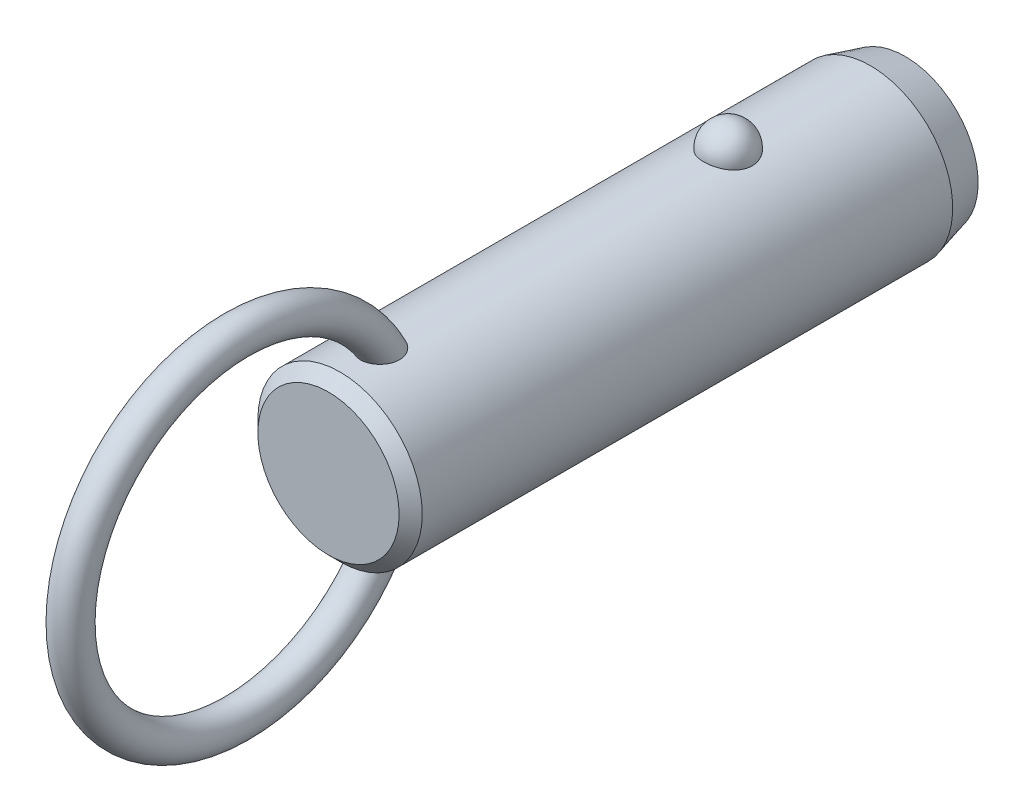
ISO-10303-21;
HEADER;
FILE_DESCRIPTION(('STEP AP214'),'2;1');
FILE_NAME('part.step','',(''),(''),'','','');
FILE_SCHEMA(('AUTOMOTIVE_DESIGN { 1 0 10303 214 1 1 1 1 }'));
ENDSEC;
DATA;
#1=APPLICATION_CONTEXT('core data for automotive mechanical design processes');
#2=APPLICATION_PROTOCOL_DEFINITION('international standard','automotive_design',2000,#1);
#3=PRODUCT_CONTEXT('',#1,'mechanical');
#4=PRODUCT('Part','Part','',(#3));
#5=PRODUCT_RELATED_PRODUCT_CATEGORY('part','',(#4));
#6=PRODUCT_DEFINITION_FORMATION('','',#4);
#7=PRODUCT_DEFINITION_CONTEXT('part definition',#1,'design');
#8=PRODUCT_DEFINITION('design','',#6,#7);
#9=PRODUCT_DEFINITION_SHAPE('','',#8);
#10=(LENGTH_UNIT() NAMED_UNIT(*) SI_UNIT(.MILLI.,.METRE.));
#11=(NAMED_UNIT(*) PLANE_ANGLE_UNIT() SI_UNIT($,.RADIAN.));
#12=(NAMED_UNIT(*) SI_UNIT($,.STERADIAN.) SOLID_ANGLE_UNIT());
#13=UNCERTAINTY_MEASURE_WITH_UNIT(LENGTH_MEASURE(1.E-05),#10,'distance_accuracy_value','');
#14=(GEOMETRIC_REPRESENTATION_CONTEXT(3) GLOBAL_UNCERTAINTY_ASSIGNED_CONTEXT((#13)) GLOBAL_UNIT_ASSIGNED_CONTEXT((#10,
#11,#12)) REPRESENTATION_CONTEXT('',''));
#15=CARTESIAN_POINT('',(0.,0.,0.));
#16=DIRECTION('',(0.,0.,1.));
#17=DIRECTION('',(1.,0.,0.));
#18=AXIS2_PLACEMENT_3D('',#15,#16,#17);
#19=CARTESIAN_POINT('',(0.,0.,24.5));
#20=DIRECTION('',(0.,0.,-1.));
#21=DIRECTION('',(-1.,0.,0.));
#22=AXIS2_PLACEMENT_3D('',#19,#20,#21);
#23=CYLINDRICAL_SURFACE('',#22,7.1);
#24=CARTESIAN_POINT('',(2.0769088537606,6.78943661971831,-2.1));
#25=CARTESIAN_POINT('',(2.07690739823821,6.78943796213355,-1.98268154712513));
#26=CARTESIAN_POINT('',(2.06738130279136,6.79237331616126,-1.86534506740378));
#27=CARTESIAN_POINT('',(2.0295040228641,6.8037853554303,-1.63400788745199));
#28=CARTESIAN_POINT('',(2.00114757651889,6.81226358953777,-1.52000812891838));
#29=CARTESIAN_POINT('',(1.92632025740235,6.83379798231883,-1.29863433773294));
#30=CARTESIAN_POINT('',(1.87985726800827,6.84685214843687,-1.19125744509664));
#31=CARTESIAN_POINT('',(1.76995205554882,6.87608091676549,-0.98604657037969));
#32=CARTESIAN_POINT('',(1.70650980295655,6.8922555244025,-0.88821260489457));
#33=CARTESIAN_POINT('',(1.5638119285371,6.92602930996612,-0.704242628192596));
#34=CARTESIAN_POINT('',(1.4844714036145,6.94363582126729,-0.618173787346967));
#35=CARTESIAN_POINT('',(1.31221746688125,6.97823658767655,-0.460740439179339));
#36=CARTESIAN_POINT('',(1.21930409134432,6.99523084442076,-0.389375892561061));
#37=CARTESIAN_POINT('',(1.02268781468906,7.02666176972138,-0.263547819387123));
#38=CARTESIAN_POINT('',(0.91902009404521,7.04110638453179,-0.209031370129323));
#39=CARTESIAN_POINT('',(0.703548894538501,7.06588726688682,-0.118163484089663));
#40=CARTESIAN_POINT('',(0.591746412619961,7.07622403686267,-0.0818098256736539));
#41=CARTESIAN_POINT('',(0.365557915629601,7.09147068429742,-0.0288711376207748));
#42=CARTESIAN_POINT('',(0.251267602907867,7.09648447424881,-0.0119070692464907));
#43=CARTESIAN_POINT('',(0.0213499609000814,7.10089837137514,0.00304925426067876));
#44=CARTESIAN_POINT('',(-0.0942772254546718,7.10029907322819,0.00104351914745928));
#45=CARTESIAN_POINT('',(-0.321651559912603,7.09360829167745,-0.0216931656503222));
#46=CARTESIAN_POINT('',(-0.433431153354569,7.08760388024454,-0.0421272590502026));
#47=CARTESIAN_POINT('',(-0.651862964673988,7.07086131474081,-0.100729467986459));
#48=CARTESIAN_POINT('',(-0.758515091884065,7.06012307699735,-0.138897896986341));
#49=CARTESIAN_POINT('',(-0.964449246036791,7.03496097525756,-0.232213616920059));
#50=CARTESIAN_POINT('',(-1.06368095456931,7.02051445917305,-0.287465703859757));
#51=CARTESIAN_POINT('',(-1.25145353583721,6.98948740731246,-0.413383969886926));
#52=CARTESIAN_POINT('',(-1.33999321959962,6.97290663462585,-0.48405186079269));
#53=CARTESIAN_POINT('',(-1.50591604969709,6.93898770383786,-0.640594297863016));
#54=CARTESIAN_POINT('',(-1.58302488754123,6.92164094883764,-0.726757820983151));
#55=CARTESIAN_POINT('',(-1.72189320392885,6.8884103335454,-0.91092752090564));
#56=CARTESIAN_POINT('',(-1.78365144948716,6.87252659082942,-1.008934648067));
#57=CARTESIAN_POINT('',(-1.89101272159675,6.84377189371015,-1.21549497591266));
#58=CARTESIAN_POINT('',(-1.93639553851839,6.83094274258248,-1.32416860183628));
#59=CARTESIAN_POINT('',(-2.00874275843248,6.81002070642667,-1.54791500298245));
#60=CARTESIAN_POINT('',(-2.03570774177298,6.80192767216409,-1.66298757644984));
#61=CARTESIAN_POINT('',(-2.07047276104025,6.7914266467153,-1.89571453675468));
#62=CARTESIAN_POINT('',(-2.07835878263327,6.78899315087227,-2.01335491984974));
#63=CARTESIAN_POINT('',(-2.07502083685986,6.79001409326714,-2.24833570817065));
#64=CARTESIAN_POINT('',(-2.06379746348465,6.7934683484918,-2.36567612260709));
#65=CARTESIAN_POINT('',(-2.02263913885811,6.80583442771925,-2.59603194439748));
#66=CARTESIAN_POINT('',(-1.99281127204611,6.81471501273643,-2.70906820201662));
#67=CARTESIAN_POINT('',(-1.91526639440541,6.83691232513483,-2.92836575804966));
#68=CARTESIAN_POINT('',(-1.8675486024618,6.85022924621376,-3.03462676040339));
#69=CARTESIAN_POINT('',(-1.75504492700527,6.87991336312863,-3.23806487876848));
#70=CARTESIAN_POINT('',(-1.69015924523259,6.89629822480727,-3.33518422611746));
#71=CARTESIAN_POINT('',(-1.54505404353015,6.93024852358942,-3.51697105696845));
#72=CARTESIAN_POINT('',(-1.46483385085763,6.94781401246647,-3.60163799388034));
#73=CARTESIAN_POINT('',(-1.29071406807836,6.98225977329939,-3.75654119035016));
#74=CARTESIAN_POINT('',(-1.19675650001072,6.99913673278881,-3.82671308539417));
#75=CARTESIAN_POINT('',(-0.997940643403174,7.03023618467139,-3.9501837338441));
#76=CARTESIAN_POINT('',(-0.89308318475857,7.04445887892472,-4.00348377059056));
#77=CARTESIAN_POINT('',(-0.676902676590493,7.06848365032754,-4.09107242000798));
#78=CARTESIAN_POINT('',(-0.565686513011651,7.0783430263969,-4.12560889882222));
#79=CARTESIAN_POINT('',(-0.338739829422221,7.09282534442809,-4.17575450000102));
#80=CARTESIAN_POINT('',(-0.223009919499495,7.09744899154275,-4.19136617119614));
#81=CARTESIAN_POINT('',(0.00707628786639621,7.10090930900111,-4.20307965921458));
#82=CARTESIAN_POINT('',(0.121410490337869,7.09986531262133,-4.19958377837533));
#83=CARTESIAN_POINT('',(0.347815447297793,7.092380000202,-4.17411564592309));
#84=CARTESIAN_POINT('',(0.459886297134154,7.08593891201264,-4.15214417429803));
#85=CARTESIAN_POINT('',(0.678084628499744,7.06838983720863,-4.09049562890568));
#86=CARTESIAN_POINT('',(0.784237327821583,7.05730369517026,-4.05090137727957));
#87=CARTESIAN_POINT('',(0.988305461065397,7.03163139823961,-3.95511447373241));
#88=CARTESIAN_POINT('',(1.08622031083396,7.01704499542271,-3.89892064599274));
#89=CARTESIAN_POINT('',(1.27284490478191,6.98562668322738,-3.77035541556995));
#90=CARTESIAN_POINT('',(1.36137372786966,6.96876135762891,-3.69772964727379));
#91=CARTESIAN_POINT('',(1.52509486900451,6.93477412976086,-3.53878279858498));
#92=CARTESIAN_POINT('',(1.60028496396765,6.91765218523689,-3.45245943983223));
#93=CARTESIAN_POINT('',(1.73681688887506,6.88465753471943,-3.26658774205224));
#94=CARTESIAN_POINT('',(1.79785966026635,6.86881574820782,-3.16681408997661));
#95=CARTESIAN_POINT('',(1.90265327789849,6.84053157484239,-2.95814408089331));
#96=CARTESIAN_POINT('',(1.94640861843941,6.82808830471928,-2.84925010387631));
#97=CARTESIAN_POINT('',(2.01274378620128,6.80881460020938,-2.63454318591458));
#98=CARTESIAN_POINT('',(2.03676193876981,6.80160856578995,-2.52920574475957));
#99=CARTESIAN_POINT('',(2.06884490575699,6.79191902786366,-2.3159172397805));
#100=CARTESIAN_POINT('',(2.07691019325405,6.78943538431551,-2.20796625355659));
#101=CARTESIAN_POINT('',(2.0769088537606,6.78943661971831,-2.1));
#102=B_SPLINE_CURVE_WITH_KNOTS('',3,(#24,#25,#26,#27,#28,#29,#30,#31,#32,#33,#34,#35,#36,#37,
#38,#39,#40,#41,#42,#43,#44,#45,#46,#47,#48,#49,#50,#51,#52,#53,#54,#55,#56,#57,#58,#59,#60,#61,
#62,#63,#64,#65,#66,#67,#68,#69,#70,#71,#72,#73,#74,#75,#76,#77,#78,#79,#80,#81,#82,#83,#84,#85,
#86,#87,#88,#89,#90,#91,#92,#93,#94,#95,#96,#97,#98,#99,#100,#101),.UNSPECIFIED.,.T.,.F.,(4,2,2,
2,2,2,2,2,2,2,2,2,2,2,2,2,2,2,2,2,2,2,2,2,2,2,2,2,2,2,2,2,2,2,2,2,2,2,4),(0.,0.351568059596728,
0.703234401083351,1.05474780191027,1.40626181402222,1.75970563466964,2.11314851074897,
2.4654696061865,2.81774759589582,3.16301449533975,3.50824481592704,3.84801136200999,
4.18778391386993,4.52968352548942,4.87162112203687,5.22076181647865,5.56993054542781,
5.92363364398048,6.27732559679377,6.62942052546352,6.98150450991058,7.33158042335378,
7.68167162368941,8.03384443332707,8.38603269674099,8.73975272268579,9.09344583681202,
9.44234545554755,9.79119807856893,10.1327344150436,10.4742563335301,10.8141898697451,
11.1541474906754,11.4997793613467,11.8454687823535,12.1979079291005,12.5502553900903,
12.8738073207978,13.1973496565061),.UNSPECIFIED.);
#103=CARTESIAN_POINT('',(2.0769088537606,6.78943661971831,-2.1));
#104=VERTEX_POINT('',#103);
#105=EDGE_CURVE('E41',#104,#104,#102,.T.);
#106=ORIENTED_EDGE('',*,*,#105,.T.);
#107=EDGE_LOOP('',(#106));
#108=FACE_BOUND('',#107,.T.);
#109=CARTESIAN_POINT('',(0.,0.,31.42));
#110=DIRECTION('',(0.,0.,1.));
#111=DIRECTION('',(1.,0.,0.));
#112=AXIS2_PLACEMENT_3D('',#109,#110,#111);
#113=CIRCLE('',#112,7.1);
#114=CARTESIAN_POINT('',(7.1,0.,31.42));
#115=VERTEX_POINT('',#114);
#116=EDGE_CURVE('E10',#115,#115,#113,.F.);
#117=ORIENTED_EDGE('',*,*,#116,.T.);
#118=EDGE_LOOP('',(#117));
#119=FACE_BOUND('',#118,.T.);
#120=CARTESIAN_POINT('',(-0.429539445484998,-7.08699541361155,26.2429212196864));
#121=CARTESIAN_POINT('',(-0.508331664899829,-7.08221999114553,26.2668764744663));
#122=CARTESIAN_POINT('',(-0.585039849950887,-7.07624016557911,26.2974570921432));
#123=CARTESIAN_POINT('',(-0.732082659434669,-7.06254296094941,26.3710242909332));
#124=CARTESIAN_POINT('',(-0.802417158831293,-7.05482554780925,26.4140111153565));
#125=CARTESIAN_POINT('',(-0.934722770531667,-7.03851844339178,26.5111135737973));
#126=CARTESIAN_POINT('',(-0.99670020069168,-7.02992941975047,26.5652207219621));
#127=CARTESIAN_POINT('',(-1.11079942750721,-7.01280697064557,26.6829676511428));
#128=CARTESIAN_POINT('',(-1.16292136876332,-7.00427354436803,26.7466072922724));
#129=CARTESIAN_POINT('',(-1.25705660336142,-6.98799959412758,26.8826870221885));
#130=CARTESIAN_POINT('',(-1.29888032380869,-6.98027525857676,26.9552598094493));
#131=CARTESIAN_POINT('',(-1.37069920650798,-6.96652886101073,27.1061686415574));
#132=CARTESIAN_POINT('',(-1.40069157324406,-6.96050720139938,27.1845060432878));
#133=CARTESIAN_POINT('',(-1.45043507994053,-6.95031881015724,27.3501903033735));
#134=CARTESIAN_POINT('',(-1.46937115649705,-6.94630231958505,27.4377897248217));
#135=CARTESIAN_POINT('',(-1.49424917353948,-6.94099239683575,27.6148714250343));
#136=CARTESIAN_POINT('',(-1.50018601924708,-6.93970003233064,27.7043544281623));
#137=CARTESIAN_POINT('',(-1.49978214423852,-6.93978815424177,27.8940607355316));
#138=CARTESIAN_POINT('',(-1.49187639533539,-6.94150934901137,27.994279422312));
#139=CARTESIAN_POINT('',(-1.46177925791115,-6.94790814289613,28.1924798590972));
#140=CARTESIAN_POINT('',(-1.43957541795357,-6.95258831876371,28.290459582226));
#141=CARTESIAN_POINT('',(-1.37783293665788,-6.96510647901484,28.4953629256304));
#142=CARTESIAN_POINT('',(-1.33634073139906,-6.97328848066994,28.6016801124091));
#143=CARTESIAN_POINT('',(-1.23686994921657,-6.99161706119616,28.8061777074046));
#144=CARTESIAN_POINT('',(-1.17889192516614,-7.00176357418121,28.9043583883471));
#145=CARTESIAN_POINT('',(-1.05875124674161,-7.02082898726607,29.0723743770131));
#146=CARTESIAN_POINT('',(-0.999247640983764,-7.02963746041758,29.1441230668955));
#147=CARTESIAN_POINT('',(-0.869494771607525,-7.04686074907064,29.2771959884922));
#148=CARTESIAN_POINT('',(-0.799263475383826,-7.05527619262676,29.3385372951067));
#149=CARTESIAN_POINT('',(-0.665408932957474,-7.06899457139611,29.4351316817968));
#150=CARTESIAN_POINT('',(-0.60381789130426,-7.07457275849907,29.4731512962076));
#151=CARTESIAN_POINT('',(-0.475172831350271,-7.08437420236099,29.5387581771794));
#152=CARTESIAN_POINT('',(-0.408123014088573,-7.08859848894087,29.5663533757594));
#153=CARTESIAN_POINT('',(-0.269431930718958,-7.09522749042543,29.6092569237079));
#154=CARTESIAN_POINT('',(-0.197757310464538,-7.09761688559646,29.6244618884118));
#155=CARTESIAN_POINT('',(-0.0527849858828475,-7.10017268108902,29.6407168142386));
#156=CARTESIAN_POINT('',(0.0205115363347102,-7.10034065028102,29.6417767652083));
#157=CARTESIAN_POINT('',(0.156426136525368,-7.09855986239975,29.6304619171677));
#158=CARTESIAN_POINT('',(0.21919982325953,-7.09688191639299,29.6198060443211));
#159=CARTESIAN_POINT('',(0.342134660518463,-7.09201880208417,29.5885379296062));
#160=CARTESIAN_POINT('',(0.402295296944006,-7.08883333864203,29.5679237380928));
#161=CARTESIAN_POINT('',(0.520687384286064,-7.08113868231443,29.5172125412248));
#162=CARTESIAN_POINT('',(0.578791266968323,-7.07658958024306,29.4868272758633));
#163=CARTESIAN_POINT('',(0.690173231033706,-7.06659708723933,29.4183678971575));
#164=CARTESIAN_POINT('',(0.74344785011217,-7.061153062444,29.3802883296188));
#165=CARTESIAN_POINT('',(0.870947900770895,-7.04680292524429,29.2765929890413));
#166=CARTESIAN_POINT('',(0.941828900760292,-7.0375580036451,29.2068972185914));
#167=CARTESIAN_POINT('',(1.07136606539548,-7.01900793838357,29.0569450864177));
#168=CARTESIAN_POINT('',(1.13000013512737,-7.00970271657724,28.9766700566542));
#169=CARTESIAN_POINT('',(1.23579584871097,-6.99183327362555,28.8068997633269));
#170=CARTESIAN_POINT('',(1.2827427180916,-6.98328455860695,28.7172696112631));
#171=CARTESIAN_POINT('',(1.36351442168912,-6.96796352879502,28.5321763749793));
#172=CARTESIAN_POINT('',(1.39733971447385,-6.96119115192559,28.4367134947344));
#173=CARTESIAN_POINT('',(1.45579181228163,-6.94922464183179,28.2253092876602));
#174=CARTESIAN_POINT('',(1.47790145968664,-6.94449000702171,28.108631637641));
#175=CARTESIAN_POINT('',(1.50168752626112,-6.93938731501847,27.8730153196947));
#176=CARTESIAN_POINT('',(1.50336085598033,-6.93901991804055,27.7540763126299));
#177=CARTESIAN_POINT('',(1.48486516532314,-6.9430010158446,27.5236079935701));
#178=CARTESIAN_POINT('',(1.46573441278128,-6.9471253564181,27.411995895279));
#179=CARTESIAN_POINT('',(1.40606892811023,-6.95944667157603,27.1948868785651));
#180=CARTESIAN_POINT('',(1.3655644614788,-6.96763788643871,27.0893815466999));
#181=CARTESIAN_POINT('',(1.27082700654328,-6.98548038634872,26.9042879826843));
#182=CARTESIAN_POINT('',(1.21949810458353,-6.99473841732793,26.8231719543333));
#183=CARTESIAN_POINT('',(1.10242050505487,-7.01414069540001,26.6722278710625));
#184=CARTESIAN_POINT('',(1.03668119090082,-7.02428436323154,26.6023925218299));
#185=CARTESIAN_POINT('',(0.900559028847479,-7.04295285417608,26.4835735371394));
#186=CARTESIAN_POINT('',(0.831428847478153,-7.05153466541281,26.4331573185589));
#187=CARTESIAN_POINT('',(0.685291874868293,-7.06723150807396,26.3451429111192));
#188=CARTESIAN_POINT('',(0.60828720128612,-7.0743469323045,26.3075412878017));
#189=CARTESIAN_POINT('',(0.451878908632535,-7.08602232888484,26.2474915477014));
#190=CARTESIAN_POINT('',(0.372686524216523,-7.09067127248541,26.2245088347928));
#191=CARTESIAN_POINT('',(0.21147739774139,-7.09730788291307,26.1920357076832));
#192=CARTESIAN_POINT('',(0.129460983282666,-7.09929585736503,26.1825437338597));
#193=CARTESIAN_POINT('',(-0.0332905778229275,-7.10037858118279,26.1773517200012));
#194=CARTESIAN_POINT('',(-0.114016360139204,-7.09953334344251,26.1813656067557));
#195=CARTESIAN_POINT('',(-0.273670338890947,-7.09517338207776,26.2024540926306));
#196=CARTESIAN_POINT('',(-0.352598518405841,-7.09165863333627,26.2195288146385));
#197=CARTESIAN_POINT('',(-0.429539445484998,-7.08699541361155,26.2429212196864));
#198=B_SPLINE_CURVE_WITH_KNOTS('',3,(#120,#121,#122,#123,#124,#125,#126,#127,#128,#129,#130,
#131,#132,#133,#134,#135,#136,#137,#138,#139,#140,#141,#142,#143,#144,#145,#146,#147,#148,#149,
#150,#151,#152,#153,#154,#155,#156,#157,#158,#159,#160,#161,#162,#163,#164,#165,#166,#167,#168,
#169,#170,#171,#172,#173,#174,#175,#176,#177,#178,#179,#180,#181,#182,#183,#184,#185,#186,#187,
#188,#189,#190,#191,#192,#193,#194,#195,#196,#197),.UNSPECIFIED.,.T.,.F.,(4,2,2,2,2,2,2,2,2,2,2,
2,2,2,2,2,2,2,2,2,2,2,2,2,2,2,2,2,2,2,2,2,2,2,2,2,2,2,4),(0.,0.247183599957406,
0.494372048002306,0.741372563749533,0.988369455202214,1.23962059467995,1.49093106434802,
1.75897818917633,2.02713035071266,2.32758265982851,2.62829697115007,2.97008736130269,
3.31186629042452,3.59175319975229,3.87117637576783,4.08813841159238,4.30493502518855,
4.52352259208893,4.7419557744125,4.93215328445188,5.12238804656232,5.31884850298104,
5.51544871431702,5.81332317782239,6.11173048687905,6.41527266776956,6.71880423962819,
7.07358156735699,7.42841252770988,7.76631485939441,8.10373999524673,8.39142246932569,
8.67891817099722,8.93560332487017,9.19221962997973,9.43881106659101,9.68537399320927,
9.92674752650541,10.1681233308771),.UNSPECIFIED.);
#199=CARTESIAN_POINT('',(-0.429539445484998,-7.08699541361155,26.2429212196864));
#200=VERTEX_POINT('',#199);
#201=EDGE_CURVE('E59',#200,#200,#198,.T.);
#202=ORIENTED_EDGE('',*,*,#201,.T.);
#203=EDGE_LOOP('',(#202));
#204=FACE_BOUND('',#203,.T.);
#205=CARTESIAN_POINT('',(-0.429539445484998,7.08699541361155,26.2429212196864));
#206=CARTESIAN_POINT('',(-0.35166550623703,7.09171429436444,26.2192469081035));
#207=CARTESIAN_POINT('',(-0.271733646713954,7.09525896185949,26.2020369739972));
#208=CARTESIAN_POINT('',(-0.110026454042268,7.09960839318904,26.1810059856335));
#209=CARTESIAN_POINT('',(-0.0282502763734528,7.10041187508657,26.177191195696));
#210=CARTESIAN_POINT('',(0.134782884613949,7.09918849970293,26.183059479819));
#211=CARTESIAN_POINT('',(0.216039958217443,7.09716214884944,26.1927401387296));
#212=CARTESIAN_POINT('',(0.375730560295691,7.09050177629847,26.2253471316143));
#213=CARTESIAN_POINT('',(0.454164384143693,7.08586802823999,26.2482720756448));
#214=CARTESIAN_POINT('',(0.606025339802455,7.07449911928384,26.306771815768));
#215=CARTESIAN_POINT('',(0.679451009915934,7.06776334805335,26.3423502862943));
#216=CARTESIAN_POINT('',(0.819234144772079,7.05292866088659,26.4251753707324));
#217=CARTESIAN_POINT('',(0.885591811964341,7.04482978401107,26.4724216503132));
#218=CARTESIAN_POINT('',(1.00993211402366,7.02808709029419,26.5775902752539));
#219=CARTESIAN_POINT('',(1.06785399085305,7.01943990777,26.635583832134));
#220=CARTESIAN_POINT('',(1.17342527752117,7.00256662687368,26.7603013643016));
#221=CARTESIAN_POINT('',(1.22107408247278,6.99434055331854,26.8270258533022));
#222=CARTESIAN_POINT('',(1.30652927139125,6.97889183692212,26.9693622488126));
#223=CARTESIAN_POINT('',(1.34399711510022,6.97170674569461,27.0451808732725));
#224=CARTESIAN_POINT('',(1.40682616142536,6.95930080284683,27.2018100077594));
#225=CARTESIAN_POINT('',(1.43218374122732,6.95408053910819,27.2826220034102));
#226=CARTESIAN_POINT('',(1.47246409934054,6.94566853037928,27.4535314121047));
#227=CARTESIAN_POINT('',(1.48642590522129,6.9426653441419,27.5438630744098));
#228=CARTESIAN_POINT('',(1.5011410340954,6.93949744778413,27.725619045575));
#229=CARTESIAN_POINT('',(1.50188917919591,6.93933385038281,27.8170437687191));
#230=CARTESIAN_POINT('',(1.49030464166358,6.94183245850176,28.0108438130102));
#231=CARTESIAN_POINT('',(1.47627413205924,6.94486147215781,28.113112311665));
#232=CARTESIAN_POINT('',(1.43356351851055,6.95380194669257,28.3144719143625));
#233=CARTESIAN_POINT('',(1.4048676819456,6.95971650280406,28.4135594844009));
#234=CARTESIAN_POINT('',(1.32908750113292,6.97461208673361,28.6189087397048));
#235=CARTESIAN_POINT('',(1.28011435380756,6.98388945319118,28.7244566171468));
#236=CARTESIAN_POINT('',(1.16520357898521,7.00397743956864,28.9257604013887));
#237=CARTESIAN_POINT('',(1.09927694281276,7.01478706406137,29.0215225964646));
#238=CARTESIAN_POINT('',(0.969361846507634,7.03373936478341,29.1767565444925));
#239=CARTESIAN_POINT('',(0.909042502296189,7.04187023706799,29.2393032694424));
#240=CARTESIAN_POINT('',(0.77917855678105,7.05741732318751,29.3540535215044));
#241=CARTESIAN_POINT('',(0.709649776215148,7.06483472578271,29.4062744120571));
#242=CARTESIAN_POINT('',(0.576854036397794,7.0767751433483,29.4881138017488));
#243=CARTESIAN_POINT('',(0.515118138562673,7.08158033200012,29.5201641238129));
#244=CARTESIAN_POINT('',(0.387127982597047,7.08972701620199,29.5737656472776));
#245=CARTESIAN_POINT('',(0.320877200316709,7.09306962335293,29.5953248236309));
#246=CARTESIAN_POINT('',(0.185041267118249,7.09791507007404,29.6264005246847));
#247=CARTESIAN_POINT('',(0.115437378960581,7.09940591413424,29.6358385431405));
#248=CARTESIAN_POINT('',(-0.0243157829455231,7.10030171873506,29.6415226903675));
#249=CARTESIAN_POINT('',(-0.0944648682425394,7.0997073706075,29.6377731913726));
#250=CARTESIAN_POINT('',(-0.22571387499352,7.09668414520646,29.6185081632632));
#251=CARTESIAN_POINT('',(-0.287006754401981,7.09444865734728,29.6042323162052));
#252=CARTESIAN_POINT('',(-0.406555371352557,7.08860360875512,29.5663685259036));
#253=CARTESIAN_POINT('',(-0.464809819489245,7.08499346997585,29.5427766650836));
#254=CARTESIAN_POINT('',(-0.594955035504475,7.07541654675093,29.4789232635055));
#255=CARTESIAN_POINT('',(-0.665389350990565,7.06906574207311,29.435753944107));
#256=CARTESIAN_POINT('',(-0.798242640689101,7.05530261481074,29.338587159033));
#257=CARTESIAN_POINT('',(-0.860645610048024,7.0478882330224,29.2845686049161));
#258=CARTESIAN_POINT('',(-0.994249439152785,7.03045217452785,29.1509965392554));
#259=CARTESIAN_POINT('',(-1.06260129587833,7.02030745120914,29.0686143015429));
#260=CARTESIAN_POINT('',(-1.18502045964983,7.00068382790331,28.893843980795));
#261=CARTESIAN_POINT('',(-1.23907684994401,6.99120544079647,28.801448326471));
#262=CARTESIAN_POINT('',(-1.33335589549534,6.97384343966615,28.6080085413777));
#263=CARTESIAN_POINT('',(-1.3733613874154,6.96598557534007,28.5068564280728));
#264=CARTESIAN_POINT('',(-1.43770677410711,6.9529905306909,28.2995046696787));
#265=CARTESIAN_POINT('',(-1.46204473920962,6.94785368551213,28.19330440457));
#266=CARTESIAN_POINT('',(-1.49537533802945,6.94076296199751,27.9682317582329));
#267=CARTESIAN_POINT('',(-1.50273564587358,6.93914842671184,27.8490975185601));
#268=CARTESIAN_POINT('',(-1.4954555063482,6.94072368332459,27.6114703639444));
#269=CARTESIAN_POINT('',(-1.48082914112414,6.94391040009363,27.4929770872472));
#270=CARTESIAN_POINT('',(-1.43076401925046,6.95438579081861,27.2734325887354));
#271=CARTESIAN_POINT('',(-1.39762227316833,6.96121852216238,27.1718413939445));
#272=CARTESIAN_POINT('',(-1.31211274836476,6.97783941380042,26.9773513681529));
#273=CARTESIAN_POINT('',(-1.2597660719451,6.98762432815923,26.8844431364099));
#274=CARTESIAN_POINT('',(-1.14583073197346,7.00713153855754,26.7241601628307));
#275=CARTESIAN_POINT('',(-1.0866594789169,7.01665982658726,26.6550351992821));
#276=CARTESIAN_POINT('',(-0.956606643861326,7.03556646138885,26.5288786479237));
#277=CARTESIAN_POINT('',(-0.88573712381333,7.04494495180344,26.4718347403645));
#278=CARTESIAN_POINT('',(-0.75155804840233,7.06035735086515,26.3831004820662));
#279=CARTESIAN_POINT('',(-0.690120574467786,7.0666695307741,26.3485932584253));
#280=CARTESIAN_POINT('',(-0.562815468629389,7.07794609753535,26.2887507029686));
#281=CARTESIAN_POINT('',(-0.496948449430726,7.08291067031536,26.2634141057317));
#282=CARTESIAN_POINT('',(-0.429539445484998,7.08699541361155,26.2429212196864));
#283=B_SPLINE_CURVE_WITH_KNOTS('',3,(#205,#206,#207,#208,#209,#210,#211,#212,#213,#214,#215,
#216,#217,#218,#219,#220,#221,#222,#223,#224,#225,#226,#227,#228,#229,#230,#231,#232,#233,#234,
#235,#236,#237,#238,#239,#240,#241,#242,#243,#244,#245,#246,#247,#248,#249,#250,#251,#252,#253,
#254,#255,#256,#257,#258,#259,#260,#261,#262,#263,#264,#265,#266,#267,#268,#269,#270,#271,#272,
#273,#274,#275,#276,#277,#278,#279,#280,#281,#282),.UNSPECIFIED.,.T.,.F.,(4,2,2,2,2,2,2,2,2,2,2,
2,2,2,2,2,2,2,2,2,2,2,2,2,2,2,2,2,2,2,2,2,2,2,2,2,2,2,4),(0.,0.244335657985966,
0.488785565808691,0.733191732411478,0.977572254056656,1.22202379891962,1.46646834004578,
1.71259457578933,1.9587352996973,2.21226768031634,2.46587585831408,2.7391381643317,
3.01250754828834,3.32109936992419,3.63002293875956,3.97863512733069,4.32702187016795,
4.58793945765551,4.84841449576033,5.05676704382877,5.26496096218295,5.47449661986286,
5.68396281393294,5.8720544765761,6.06022532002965,6.30743751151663,6.55513496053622,
6.87602468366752,7.19715875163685,7.52305774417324,7.84899686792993,8.20516155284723,
8.5610982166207,8.88040084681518,9.19935367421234,9.47236282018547,9.7450922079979,
9.95662250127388,10.1681235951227),.UNSPECIFIED.);
#284=CARTESIAN_POINT('',(-0.429539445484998,7.08699541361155,26.2429212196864));
#285=VERTEX_POINT('',#284);
#286=EDGE_CURVE('E67',#285,#285,#283,.T.);
#287=ORIENTED_EDGE('',*,*,#286,.T.);
#288=EDGE_LOOP('',(#287));
#289=FACE_BOUND('',#288,.T.);
#290=CARTESIAN_POINT('',(0.,0.,-14.4));
#291=DIRECTION('',(0.,0.,-1.));
#292=DIRECTION('',(-1.,0.,0.));
#293=AXIS2_PLACEMENT_3D('',#290,#291,#292);
#294=CIRCLE('',#293,7.1);
#295=CARTESIAN_POINT('',(-7.1,0.,-14.4));
#296=VERTEX_POINT('',#295);
#297=EDGE_CURVE('E56',#296,#296,#294,.F.);
#298=ORIENTED_EDGE('',*,*,#297,.T.);
#299=EDGE_LOOP('',(#298));
#300=FACE_BOUND('',#299,.T.);
#301=ADVANCED_FACE('F37',(#108,#119,#204,#289,#300),#23,.T.);
#302=CARTESIAN_POINT('',(0.,0.,-17.4));
#303=DIRECTION('',(0.,0.,-1.));
#304=DIRECTION('',(-1.,0.,0.));
#305=AXIS2_PLACEMENT_3D('',#302,#303,#304);
#306=PLANE('',#305);
#307=CARTESIAN_POINT('',(0.,0.,-17.4));
#308=DIRECTION('',(0.,0.,-1.));
#309=DIRECTION('',(-1.,0.,0.));
#310=AXIS2_PLACEMENT_3D('',#307,#308,#309);
#311=CIRCLE('',#310,6.29615242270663);
#312=CARTESIAN_POINT('',(-6.29615242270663,0.,-17.4));
#313=VERTEX_POINT('',#312);
#314=EDGE_CURVE('E66',#313,#313,#311,.T.);
#315=ORIENTED_EDGE('',*,*,#314,.T.);
#316=EDGE_LOOP('',(#315));
#317=FACE_BOUND('',#316,.T.);
#318=ADVANCED_FACE('F85',(#317),#306,.T.);
#319=CARTESIAN_POINT('',(0.,0.,-17.4));
#320=DIRECTION('',(0.,0.,1.));
#321=DIRECTION('',(1.,0.,0.));
#322=AXIS2_PLACEMENT_3D('',#319,#320,#321);
#323=CONICAL_SURFACE('',#322,6.29615242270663,0.261799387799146);
#324=ORIENTED_EDGE('',*,*,#297,.F.);
#325=EDGE_LOOP('',(#324));
#326=FACE_BOUND('',#325,.T.);
#327=ORIENTED_EDGE('',*,*,#314,.F.);
#328=EDGE_LOOP('',(#327));
#329=FACE_BOUND('',#328,.T.);
#330=ADVANCED_FACE('F83',(#326,#329),#323,.T.);
#331=CARTESIAN_POINT('',(0.,0.,32.42));
#332=DIRECTION('',(0.,0.,1.));
#333=DIRECTION('',(1.,0.,0.));
#334=AXIS2_PLACEMENT_3D('',#331,#332,#333);
#335=PLANE('',#334);
#336=CARTESIAN_POINT('',(0.,0.,32.42));
#337=DIRECTION('',(0.,0.,1.));
#338=DIRECTION('',(1.,0.,0.));
#339=AXIS2_PLACEMENT_3D('',#336,#337,#338);
#340=CIRCLE('',#339,6.10000000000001);
#341=CARTESIAN_POINT('',(6.10000000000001,0.,32.42));
#342=VERTEX_POINT('',#341);
#343=EDGE_CURVE('E50',#342,#342,#340,.T.);
#344=ORIENTED_EDGE('',*,*,#343,.T.);
#345=EDGE_LOOP('',(#344));
#346=FACE_BOUND('',#345,.T.);
#347=ADVANCED_FACE('F77',(#346),#335,.T.);
#348=CARTESIAN_POINT('',(0.,0.,40.35));
#349=DIRECTION('',(1.,0.,0.));
#350=DIRECTION('',(0.,0.,-1.));
#351=AXIS2_PLACEMENT_3D('',#348,#349,#350);
#352=TOROIDAL_SURFACE('',#351,14.35,1.5);
#353=ORIENTED_EDGE('',*,*,#286,.F.);
#354=EDGE_LOOP('',(#353));
#355=FACE_BOUND('',#354,.T.);
#356=ORIENTED_EDGE('',*,*,#201,.F.);
#357=EDGE_LOOP('',(#356));
#358=FACE_BOUND('',#357,.T.);
#359=ADVANCED_FACE('F73',(#355,#358),#352,.T.);
#360=CARTESIAN_POINT('',(0.,0.,32.42));
#361=DIRECTION('',(0.,0.,-1.));
#362=DIRECTION('',(-1.,0.,0.));
#363=AXIS2_PLACEMENT_3D('',#360,#361,#362);
#364=CONICAL_SURFACE('',#363,6.10000000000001,0.785398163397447);
#365=ORIENTED_EDGE('',*,*,#116,.F.);
#366=EDGE_LOOP('',(#365));
#367=FACE_BOUND('',#366,.T.);
#368=ORIENTED_EDGE('',*,*,#343,.F.);
#369=EDGE_LOOP('',(#368));
#370=FACE_BOUND('',#369,.T.);
#371=ADVANCED_FACE('F39',(#367,#370),#364,.T.);
#372=CARTESIAN_POINT('',(0.,7.1,-2.1));
#373=DIRECTION('',(0.,1.,0.));
#374=DIRECTION('',(0.,0.,1.));
#375=AXIS2_PLACEMENT_3D('',#372,#373,#374);
#376=SPHERICAL_SURFACE('',#375,2.10000000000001);
#377=ORIENTED_EDGE('',*,*,#105,.F.);
#378=EDGE_LOOP('',(#377));
#379=FACE_BOUND('',#378,.T.);
#380=ADVANCED_FACE('F79',(#379),#376,.T.);
#381=CLOSED_SHELL('',(#301,#318,#330,#347,#359,#371,#380));
#382=MANIFOLD_SOLID_BREP('B2',#381);
#383=ADVANCED_BREP_SHAPE_REPRESENTATION('',(#18,#382),#14);
#384=SHAPE_DEFINITION_REPRESENTATION(#9,#383);
ENDSEC;
END-ISO-10303-21;
